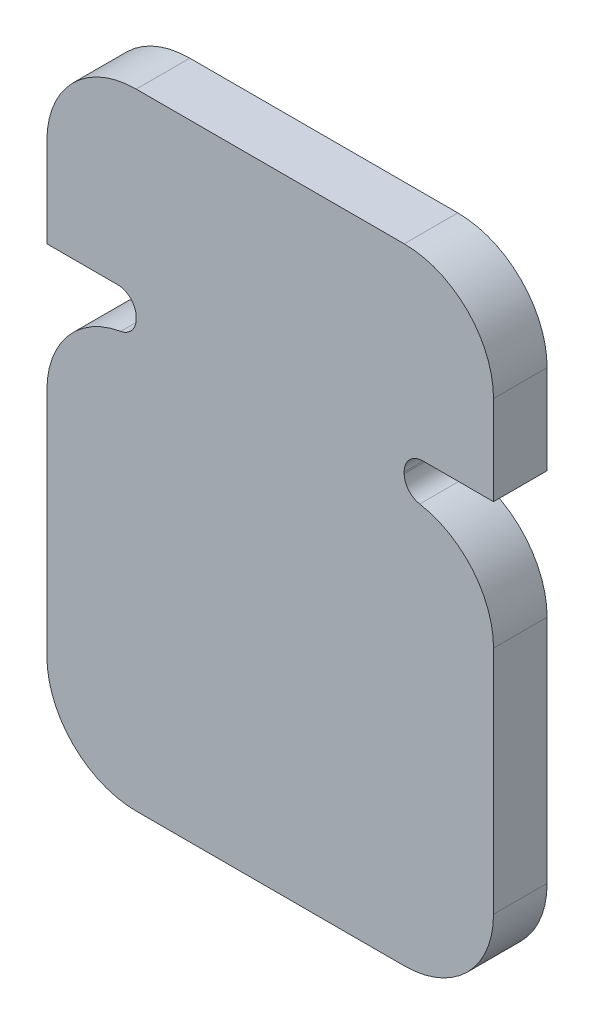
ISO-10303-21;
HEADER;
FILE_DESCRIPTION(('STEP AP214'),'2;1');
FILE_NAME('part.step','',(''),(''),'','','');
FILE_SCHEMA(('AUTOMOTIVE_DESIGN { 1 0 10303 214 1 1 1 1 }'));
ENDSEC;
DATA;
#1=APPLICATION_CONTEXT('core data for automotive mechanical design processes');
#2=APPLICATION_PROTOCOL_DEFINITION('international standard','automotive_design',2000,#1);
#3=PRODUCT_CONTEXT('',#1,'mechanical');
#4=PRODUCT('Part','Part','',(#3));
#5=PRODUCT_RELATED_PRODUCT_CATEGORY('part','',(#4));
#6=PRODUCT_DEFINITION_FORMATION('','',#4);
#7=PRODUCT_DEFINITION_CONTEXT('part definition',#1,'design');
#8=PRODUCT_DEFINITION('design','',#6,#7);
#9=PRODUCT_DEFINITION_SHAPE('','',#8);
#10=(LENGTH_UNIT() NAMED_UNIT(*) SI_UNIT(.MILLI.,.METRE.));
#11=(NAMED_UNIT(*) PLANE_ANGLE_UNIT() SI_UNIT($,.RADIAN.));
#12=(NAMED_UNIT(*) SI_UNIT($,.STERADIAN.) SOLID_ANGLE_UNIT());
#13=UNCERTAINTY_MEASURE_WITH_UNIT(LENGTH_MEASURE(1.E-05),#10,'distance_accuracy_value','');
#14=(GEOMETRIC_REPRESENTATION_CONTEXT(3) GLOBAL_UNCERTAINTY_ASSIGNED_CONTEXT((#13)) GLOBAL_UNIT_ASSIGNED_CONTEXT((#10,
#11,#12)) REPRESENTATION_CONTEXT('',''));
#15=CARTESIAN_POINT('',(0.,0.,0.));
#16=DIRECTION('',(0.,0.,1.));
#17=DIRECTION('',(1.,0.,0.));
#18=AXIS2_PLACEMENT_3D('',#15,#16,#17);
#19=CARTESIAN_POINT('',(-50.,30.,3.));
#20=DIRECTION('',(0.,-1.,0.));
#21=DIRECTION('',(0.,0.,-1.));
#22=AXIS2_PLACEMENT_3D('',#19,#20,#21);
#23=PLANE('',#22);
#24=DIRECTION('',(-1.,0.,0.));
#25=VECTOR('',#24,1.);
#26=CARTESIAN_POINT('',(-50.,30.,3.));
#27=LINE('',#26,#25);
#28=CARTESIAN_POINT('',(-30.,30.,3.));
#29=VERTEX_POINT('',#28);
#30=CARTESIAN_POINT('',(-45.,30.,3.));
#31=VERTEX_POINT('',#30);
#32=EDGE_CURVE('E203',#29,#31,#27,.T.);
#33=ORIENTED_EDGE('',*,*,#32,.F.);
#34=DIRECTION('',(0.,0.,-1.));
#35=VECTOR('',#34,1.);
#36=CARTESIAN_POINT('',(-30.,30.,3.));
#37=LINE('',#36,#35);
#38=CARTESIAN_POINT('',(-30.,30.,0.));
#39=VERTEX_POINT('',#38);
#40=EDGE_CURVE('E231',#29,#39,#37,.T.);
#41=ORIENTED_EDGE('',*,*,#40,.T.);
#42=DIRECTION('',(-1.,0.,0.));
#43=VECTOR('',#42,1.);
#44=CARTESIAN_POINT('',(-50.,30.,0.));
#45=LINE('',#44,#43);
#46=CARTESIAN_POINT('',(-45.,30.,0.));
#47=VERTEX_POINT('',#46);
#48=EDGE_CURVE('E172',#39,#47,#45,.T.);
#49=ORIENTED_EDGE('',*,*,#48,.T.);
#50=DIRECTION('',(0.,0.,-1.));
#51=VECTOR('',#50,1.);
#52=CARTESIAN_POINT('',(-45.,30.,3.));
#53=LINE('',#52,#51);
#54=EDGE_CURVE('E176',#47,#31,#53,.F.);
#55=ORIENTED_EDGE('',*,*,#54,.T.);
#56=EDGE_LOOP('',(#33,#41,#49,#55));
#57=FACE_BOUND('',#56,.T.);
#58=ADVANCED_FACE('F27',(#57),#23,.F.);
#59=CARTESIAN_POINT('',(-50.,30.,3.));
#60=DIRECTION('',(1.,0.,0.));
#61=DIRECTION('',(0.,1.,0.));
#62=AXIS2_PLACEMENT_3D('',#59,#60,#61);
#63=PLANE('',#62);
#64=DIRECTION('',(0.,-1.,0.));
#65=VECTOR('',#64,1.);
#66=CARTESIAN_POINT('',(-50.,30.,3.));
#67=LINE('',#66,#65);
#68=CARTESIAN_POINT('',(-50.,25.,3.));
#69=VERTEX_POINT('',#68);
#70=CARTESIAN_POINT('',(-50.,20.,3.));
#71=VERTEX_POINT('',#70);
#72=EDGE_CURVE('E206',#69,#71,#67,.T.);
#73=ORIENTED_EDGE('',*,*,#72,.F.);
#74=DIRECTION('',(0.,0.,-1.));
#75=VECTOR('',#74,1.);
#76=CARTESIAN_POINT('',(-50.,25.,3.));
#77=LINE('',#76,#75);
#78=CARTESIAN_POINT('',(-50.,25.,0.));
#79=VERTEX_POINT('',#78);
#80=EDGE_CURVE('E170',#69,#79,#77,.T.);
#81=ORIENTED_EDGE('',*,*,#80,.T.);
#82=DIRECTION('',(0.,-1.,0.));
#83=VECTOR('',#82,1.);
#84=CARTESIAN_POINT('',(-50.,30.,0.));
#85=LINE('',#84,#83);
#86=CARTESIAN_POINT('',(-50.,20.,0.));
#87=VERTEX_POINT('',#86);
#88=EDGE_CURVE('E164',#79,#87,#85,.T.);
#89=ORIENTED_EDGE('',*,*,#88,.T.);
#90=DIRECTION('',(0.,0.,-1.));
#91=VECTOR('',#90,1.);
#92=CARTESIAN_POINT('',(-50.,20.,3.));
#93=LINE('',#92,#91);
#94=EDGE_CURVE('E168',#71,#87,#93,.T.);
#95=ORIENTED_EDGE('',*,*,#94,.F.);
#96=EDGE_LOOP('',(#73,#81,#89,#95));
#97=FACE_BOUND('',#96,.T.);
#98=ADVANCED_FACE('F167',(#97),#63,.F.);
#99=CARTESIAN_POINT('',(-50.,20.,3.));
#100=DIRECTION('',(0.,1.,0.));
#101=DIRECTION('',(0.,0.,1.));
#102=AXIS2_PLACEMENT_3D('',#99,#100,#101);
#103=PLANE('',#102);
#104=DIRECTION('',(1.,0.,0.));
#105=VECTOR('',#104,1.);
#106=CARTESIAN_POINT('',(-50.,20.,0.));
#107=LINE('',#106,#105);
#108=CARTESIAN_POINT('',(-46.05,20.,0.));
#109=VERTEX_POINT('',#108);
#110=EDGE_CURVE('E171',#87,#109,#107,.T.);
#111=ORIENTED_EDGE('',*,*,#110,.T.);
#112=DIRECTION('',(0.,0.,-1.));
#113=VECTOR('',#112,1.);
#114=CARTESIAN_POINT('',(-46.05,20.,3.));
#115=LINE('',#114,#113);
#116=CARTESIAN_POINT('',(-46.05,20.,3.));
#117=VERTEX_POINT('',#116);
#118=EDGE_CURVE('E41',#109,#117,#115,.F.);
#119=ORIENTED_EDGE('',*,*,#118,.T.);
#120=DIRECTION('',(1.,0.,0.));
#121=VECTOR('',#120,1.);
#122=CARTESIAN_POINT('',(-50.,20.,3.));
#123=LINE('',#122,#121);
#124=EDGE_CURVE('E175',#71,#117,#123,.T.);
#125=ORIENTED_EDGE('',*,*,#124,.F.);
#126=ORIENTED_EDGE('',*,*,#94,.T.);
#127=EDGE_LOOP('',(#111,#119,#125,#126));
#128=FACE_BOUND('',#127,.T.);
#129=ADVANCED_FACE('F174',(#128),#103,.F.);
#130=CARTESIAN_POINT('',(-45.,20.,3.));
#131=DIRECTION('',(1.,0.,0.));
#132=DIRECTION('',(0.,0.,-1.));
#133=AXIS2_PLACEMENT_3D('',#130,#131,#132);
#134=PLANE('',#133);
#135=DIRECTION('',(0.,-1.,0.));
#136=VECTOR('',#135,1.);
#137=CARTESIAN_POINT('',(-45.,20.,0.));
#138=LINE('',#137,#136);
#139=CARTESIAN_POINT('',(-45.,18.95,0.));
#140=VERTEX_POINT('',#139);
#141=CARTESIAN_POINT('',(-45.,18.8581876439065,0.));
#142=VERTEX_POINT('',#141);
#143=EDGE_CURVE('E181',#140,#142,#138,.T.);
#144=ORIENTED_EDGE('',*,*,#143,.T.);
#145=DIRECTION('',(0.,0.,-1.));
#146=VECTOR('',#145,1.);
#147=CARTESIAN_POINT('',(-45.,18.8581876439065,3.));
#148=LINE('',#147,#146);
#149=CARTESIAN_POINT('',(-45.,18.8581876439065,3.));
#150=VERTEX_POINT('',#149);
#151=EDGE_CURVE('E296',#142,#150,#148,.F.);
#152=ORIENTED_EDGE('',*,*,#151,.T.);
#153=DIRECTION('',(0.,-1.,0.));
#154=VECTOR('',#153,1.);
#155=CARTESIAN_POINT('',(-45.,20.,3.));
#156=LINE('',#155,#154);
#157=CARTESIAN_POINT('',(-45.,18.95,3.));
#158=VERTEX_POINT('',#157);
#159=EDGE_CURVE('E209',#158,#150,#156,.T.);
#160=ORIENTED_EDGE('',*,*,#159,.F.);
#161=DIRECTION('',(0.,0.,-1.));
#162=VECTOR('',#161,1.);
#163=CARTESIAN_POINT('',(-45.,18.95,0.));
#164=LINE('',#163,#162);
#165=EDGE_CURVE('E293',#158,#140,#164,.T.);
#166=ORIENTED_EDGE('',*,*,#165,.T.);
#167=EDGE_LOOP('',(#144,#152,#160,#166));
#168=FACE_BOUND('',#167,.T.);
#169=ADVANCED_FACE('F325',(#168),#134,.F.);
#170=CARTESIAN_POINT('',(-50.,17.9,3.));
#171=DIRECTION('',(1.,0.,0.));
#172=DIRECTION('',(0.,0.,-1.));
#173=AXIS2_PLACEMENT_3D('',#170,#171,#172);
#174=PLANE('',#173);
#175=DIRECTION('',(0.,-1.,0.));
#176=VECTOR('',#175,1.);
#177=CARTESIAN_POINT('',(-50.,17.9,3.));
#178=LINE('',#177,#176);
#179=CARTESIAN_POINT('',(-50.,12.9,3.));
#180=VERTEX_POINT('',#179);
#181=CARTESIAN_POINT('',(-50.,0.,3.));
#182=VERTEX_POINT('',#181);
#183=EDGE_CURVE('E212',#180,#182,#178,.T.);
#184=ORIENTED_EDGE('',*,*,#183,.F.);
#185=DIRECTION('',(0.,0.,-1.));
#186=VECTOR('',#185,1.);
#187=CARTESIAN_POINT('',(-50.,12.9,3.));
#188=LINE('',#187,#186);
#189=CARTESIAN_POINT('',(-50.,12.9,0.));
#190=VERTEX_POINT('',#189);
#191=EDGE_CURVE('E277',#180,#190,#188,.T.);
#192=ORIENTED_EDGE('',*,*,#191,.T.);
#193=DIRECTION('',(0.,-1.,0.));
#194=VECTOR('',#193,1.);
#195=CARTESIAN_POINT('',(-50.,17.9,0.));
#196=LINE('',#195,#194);
#197=CARTESIAN_POINT('',(-50.,0.,0.));
#198=VERTEX_POINT('',#197);
#199=EDGE_CURVE('E184',#190,#198,#196,.T.);
#200=ORIENTED_EDGE('',*,*,#199,.T.);
#201=DIRECTION('',(0.,0.,-1.));
#202=VECTOR('',#201,1.);
#203=CARTESIAN_POINT('',(-50.,0.,3.));
#204=LINE('',#203,#202);
#205=EDGE_CURVE('E258',#198,#182,#204,.F.);
#206=ORIENTED_EDGE('',*,*,#205,.T.);
#207=EDGE_LOOP('',(#184,#192,#200,#206));
#208=FACE_BOUND('',#207,.T.);
#209=ADVANCED_FACE('F389',(#208),#174,.F.);
#210=CARTESIAN_POINT('',(-50.,-5.,3.));
#211=DIRECTION('',(0.,1.,0.));
#212=DIRECTION('',(0.,0.,1.));
#213=AXIS2_PLACEMENT_3D('',#210,#211,#212);
#214=PLANE('',#213);
#215=DIRECTION('',(1.,0.,0.));
#216=VECTOR('',#215,1.);
#217=CARTESIAN_POINT('',(-50.,-5.,3.));
#218=LINE('',#217,#216);
#219=CARTESIAN_POINT('',(-45.,-5.,3.));
#220=VERTEX_POINT('',#219);
#221=CARTESIAN_POINT('',(-30.,-5.,3.));
#222=VERTEX_POINT('',#221);
#223=EDGE_CURVE('E214',#220,#222,#218,.T.);
#224=ORIENTED_EDGE('',*,*,#223,.F.);
#225=DIRECTION('',(0.,0.,-1.));
#226=VECTOR('',#225,1.);
#227=CARTESIAN_POINT('',(-45.,-5.,3.));
#228=LINE('',#227,#226);
#229=CARTESIAN_POINT('',(-45.,-5.,0.));
#230=VERTEX_POINT('',#229);
#231=EDGE_CURVE('E255',#220,#230,#228,.T.);
#232=ORIENTED_EDGE('',*,*,#231,.T.);
#233=DIRECTION('',(1.,0.,0.));
#234=VECTOR('',#233,1.);
#235=CARTESIAN_POINT('',(-50.,-5.,0.));
#236=LINE('',#235,#234);
#237=CARTESIAN_POINT('',(-30.,-5.,0.));
#238=VERTEX_POINT('',#237);
#239=EDGE_CURVE('E189',#230,#238,#236,.T.);
#240=ORIENTED_EDGE('',*,*,#239,.T.);
#241=DIRECTION('',(0.,0.,-1.));
#242=VECTOR('',#241,1.);
#243=CARTESIAN_POINT('',(-30.,-5.,3.));
#244=LINE('',#243,#242);
#245=EDGE_CURVE('E253',#238,#222,#244,.F.);
#246=ORIENTED_EDGE('',*,*,#245,.T.);
#247=EDGE_LOOP('',(#224,#232,#240,#246));
#248=FACE_BOUND('',#247,.T.);
#249=ADVANCED_FACE('F382',(#248),#214,.F.);
#250=CARTESIAN_POINT('',(-25.,17.9,3.));
#251=DIRECTION('',(-1.,0.,0.));
#252=DIRECTION('',(0.,0.,1.));
#253=AXIS2_PLACEMENT_3D('',#250,#251,#252);
#254=PLANE('',#253);
#255=DIRECTION('',(0.,1.,0.));
#256=VECTOR('',#255,1.);
#257=CARTESIAN_POINT('',(-25.,17.9,0.));
#258=LINE('',#257,#256);
#259=CARTESIAN_POINT('',(-25.,0.,0.));
#260=VERTEX_POINT('',#259);
#261=CARTESIAN_POINT('',(-25.,12.9,0.));
#262=VERTEX_POINT('',#261);
#263=EDGE_CURVE('E192',#260,#262,#258,.T.);
#264=ORIENTED_EDGE('',*,*,#263,.T.);
#265=DIRECTION('',(0.,0.,-1.));
#266=VECTOR('',#265,1.);
#267=CARTESIAN_POINT('',(-25.,12.9,3.));
#268=LINE('',#267,#266);
#269=CARTESIAN_POINT('',(-25.,12.9,3.));
#270=VERTEX_POINT('',#269);
#271=EDGE_CURVE('E270',#262,#270,#268,.F.);
#272=ORIENTED_EDGE('',*,*,#271,.T.);
#273=DIRECTION('',(0.,1.,0.));
#274=VECTOR('',#273,1.);
#275=CARTESIAN_POINT('',(-25.,17.9,3.));
#276=LINE('',#275,#274);
#277=CARTESIAN_POINT('',(-25.,0.,3.));
#278=VERTEX_POINT('',#277);
#279=EDGE_CURVE('E217',#278,#270,#276,.T.);
#280=ORIENTED_EDGE('',*,*,#279,.F.);
#281=DIRECTION('',(0.,0.,-1.));
#282=VECTOR('',#281,1.);
#283=CARTESIAN_POINT('',(-25.,0.,3.));
#284=LINE('',#283,#282);
#285=EDGE_CURVE('E261',#278,#260,#284,.T.);
#286=ORIENTED_EDGE('',*,*,#285,.T.);
#287=EDGE_LOOP('',(#264,#272,#280,#286));
#288=FACE_BOUND('',#287,.T.);
#289=ADVANCED_FACE('F373',(#288),#254,.F.);
#290=CARTESIAN_POINT('',(-30.,20.,3.));
#291=DIRECTION('',(-1.,0.,0.));
#292=DIRECTION('',(0.,0.,1.));
#293=AXIS2_PLACEMENT_3D('',#290,#291,#292);
#294=PLANE('',#293);
#295=DIRECTION('',(0.,1.,0.));
#296=VECTOR('',#295,1.);
#297=CARTESIAN_POINT('',(-30.,20.,3.));
#298=LINE('',#297,#296);
#299=CARTESIAN_POINT('',(-30.,18.8581876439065,3.));
#300=VERTEX_POINT('',#299);
#301=CARTESIAN_POINT('',(-30.,18.95,3.));
#302=VERTEX_POINT('',#301);
#303=EDGE_CURVE('E220',#300,#302,#298,.T.);
#304=ORIENTED_EDGE('',*,*,#303,.F.);
#305=DIRECTION('',(0.,0.,-1.));
#306=VECTOR('',#305,1.);
#307=CARTESIAN_POINT('',(-30.,18.8581876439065,3.));
#308=LINE('',#307,#306);
#309=CARTESIAN_POINT('',(-30.,18.8581876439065,0.));
#310=VERTEX_POINT('',#309);
#311=EDGE_CURVE('E282',#300,#310,#308,.T.);
#312=ORIENTED_EDGE('',*,*,#311,.T.);
#313=DIRECTION('',(0.,1.,0.));
#314=VECTOR('',#313,1.);
#315=CARTESIAN_POINT('',(-30.,20.,0.));
#316=LINE('',#315,#314);
#317=CARTESIAN_POINT('',(-30.,18.95,0.));
#318=VERTEX_POINT('',#317);
#319=EDGE_CURVE('E195',#310,#318,#316,.T.);
#320=ORIENTED_EDGE('',*,*,#319,.T.);
#321=DIRECTION('',(0.,0.,-1.));
#322=VECTOR('',#321,1.);
#323=CARTESIAN_POINT('',(-30.,18.95,3.));
#324=LINE('',#323,#322);
#325=EDGE_CURVE('E280',#318,#302,#324,.F.);
#326=ORIENTED_EDGE('',*,*,#325,.T.);
#327=EDGE_LOOP('',(#304,#312,#320,#326));
#328=FACE_BOUND('',#327,.T.);
#329=ADVANCED_FACE('F357',(#328),#294,.F.);
#330=CARTESIAN_POINT('',(-25.,20.,3.));
#331=DIRECTION('',(0.,1.,0.));
#332=DIRECTION('',(-1.,0.,0.));
#333=AXIS2_PLACEMENT_3D('',#330,#331,#332);
#334=PLANE('',#333);
#335=DIRECTION('',(1.,0.,0.));
#336=VECTOR('',#335,1.);
#337=CARTESIAN_POINT('',(-25.,20.,3.));
#338=LINE('',#337,#336);
#339=CARTESIAN_POINT('',(-28.95,20.,3.));
#340=VERTEX_POINT('',#339);
#341=CARTESIAN_POINT('',(-25.,20.,3.));
#342=VERTEX_POINT('',#341);
#343=EDGE_CURVE('E223',#340,#342,#338,.T.);
#344=ORIENTED_EDGE('',*,*,#343,.F.);
#345=DIRECTION('',(0.,0.,-1.));
#346=VECTOR('',#345,1.);
#347=CARTESIAN_POINT('',(-28.95,20.,0.));
#348=LINE('',#347,#346);
#349=CARTESIAN_POINT('',(-28.95,20.,0.));
#350=VERTEX_POINT('',#349);
#351=EDGE_CURVE('E287',#340,#350,#348,.T.);
#352=ORIENTED_EDGE('',*,*,#351,.T.);
#353=DIRECTION('',(1.,0.,0.));
#354=VECTOR('',#353,1.);
#355=CARTESIAN_POINT('',(-25.,20.,0.));
#356=LINE('',#355,#354);
#357=CARTESIAN_POINT('',(-25.,20.,0.));
#358=VERTEX_POINT('',#357);
#359=EDGE_CURVE('E198',#350,#358,#356,.T.);
#360=ORIENTED_EDGE('',*,*,#359,.T.);
#361=DIRECTION('',(0.,0.,-1.));
#362=VECTOR('',#361,1.);
#363=CARTESIAN_POINT('',(-25.,20.,3.));
#364=LINE('',#363,#362);
#365=EDGE_CURVE('E177',#342,#358,#364,.T.);
#366=ORIENTED_EDGE('',*,*,#365,.F.);
#367=EDGE_LOOP('',(#344,#352,#360,#366));
#368=FACE_BOUND('',#367,.T.);
#369=ADVANCED_FACE('F351',(#368),#334,.F.);
#370=CARTESIAN_POINT('',(-25.,30.,3.));
#371=DIRECTION('',(-1.,0.,0.));
#372=DIRECTION('',(0.,-1.,0.));
#373=AXIS2_PLACEMENT_3D('',#370,#371,#372);
#374=PLANE('',#373);
#375=DIRECTION('',(0.,1.,0.));
#376=VECTOR('',#375,1.);
#377=CARTESIAN_POINT('',(-25.,30.,0.));
#378=LINE('',#377,#376);
#379=CARTESIAN_POINT('',(-25.,25.,0.));
#380=VERTEX_POINT('',#379);
#381=EDGE_CURVE('E200',#358,#380,#378,.T.);
#382=ORIENTED_EDGE('',*,*,#381,.T.);
#383=DIRECTION('',(0.,0.,-1.));
#384=VECTOR('',#383,1.);
#385=CARTESIAN_POINT('',(-25.,25.,3.));
#386=LINE('',#385,#384);
#387=CARTESIAN_POINT('',(-25.,25.,3.));
#388=VERTEX_POINT('',#387);
#389=EDGE_CURVE('E243',#380,#388,#386,.F.);
#390=ORIENTED_EDGE('',*,*,#389,.T.);
#391=DIRECTION('',(0.,1.,0.));
#392=VECTOR('',#391,1.);
#393=CARTESIAN_POINT('',(-25.,30.,3.));
#394=LINE('',#393,#392);
#395=EDGE_CURVE('E225',#342,#388,#394,.T.);
#396=ORIENTED_EDGE('',*,*,#395,.F.);
#397=ORIENTED_EDGE('',*,*,#365,.T.);
#398=EDGE_LOOP('',(#382,#390,#396,#397));
#399=FACE_BOUND('',#398,.T.);
#400=ADVANCED_FACE('F346',(#399),#374,.F.);
#401=CARTESIAN_POINT('',(-30.,30.,3.));
#402=DIRECTION('',(0.,0.,-1.));
#403=DIRECTION('',(-1.,0.,0.));
#404=AXIS2_PLACEMENT_3D('',#401,#402,#403);
#405=PLANE('',#404);
#406=ORIENTED_EDGE('',*,*,#279,.T.);
#407=CARTESIAN_POINT('',(-30.,12.9,3.));
#408=DIRECTION('',(0.,0.,-1.));
#409=DIRECTION('',(-1.,0.,0.));
#410=AXIS2_PLACEMENT_3D('',#407,#408,#409);
#411=CIRCLE('',#410,5.);
#412=CARTESIAN_POINT('',(-29.1322314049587,17.8241220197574,3.));
#413=VERTEX_POINT('',#412);
#414=EDGE_CURVE('E274',#270,#413,#411,.F.);
#415=ORIENTED_EDGE('',*,*,#414,.T.);
#416=CARTESIAN_POINT('',(-28.95,18.8581876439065,3.));
#417=DIRECTION('',(0.,0.,-1.));
#418=DIRECTION('',(-1.,0.,0.));
#419=AXIS2_PLACEMENT_3D('',#416,#417,#418);
#420=CIRCLE('',#419,1.05);
#421=EDGE_CURVE('E301',#413,#300,#420,.T.);
#422=ORIENTED_EDGE('',*,*,#421,.T.);
#423=ORIENTED_EDGE('',*,*,#303,.T.);
#424=CARTESIAN_POINT('',(-28.95,18.95,3.));
#425=DIRECTION('',(0.,0.,-1.));
#426=DIRECTION('',(-1.,0.,0.));
#427=AXIS2_PLACEMENT_3D('',#424,#425,#426);
#428=CIRCLE('',#427,1.05);
#429=EDGE_CURVE('E305',#302,#340,#428,.T.);
#430=ORIENTED_EDGE('',*,*,#429,.T.);
#431=ORIENTED_EDGE('',*,*,#343,.T.);
#432=ORIENTED_EDGE('',*,*,#395,.T.);
#433=CARTESIAN_POINT('',(-30.,25.,3.));
#434=DIRECTION('',(0.,0.,-1.));
#435=DIRECTION('',(-1.,0.,0.));
#436=AXIS2_PLACEMENT_3D('',#433,#434,#435);
#437=CIRCLE('',#436,5.);
#438=EDGE_CURVE('E251',#388,#29,#437,.F.);
#439=ORIENTED_EDGE('',*,*,#438,.T.);
#440=ORIENTED_EDGE('',*,*,#32,.T.);
#441=CARTESIAN_POINT('',(-45.,25.,3.));
#442=DIRECTION('',(0.,0.,-1.));
#443=DIRECTION('',(-1.,0.,0.));
#444=AXIS2_PLACEMENT_3D('',#441,#442,#443);
#445=CIRCLE('',#444,5.);
#446=EDGE_CURVE('E245',#31,#69,#445,.F.);
#447=ORIENTED_EDGE('',*,*,#446,.T.);
#448=ORIENTED_EDGE('',*,*,#72,.T.);
#449=ORIENTED_EDGE('',*,*,#124,.T.);
#450=CARTESIAN_POINT('',(-46.05,18.95,3.));
#451=DIRECTION('',(0.,0.,-1.));
#452=DIRECTION('',(-1.,0.,0.));
#453=AXIS2_PLACEMENT_3D('',#450,#451,#452);
#454=CIRCLE('',#453,1.05);
#455=EDGE_CURVE('E11',#117,#158,#454,.T.);
#456=ORIENTED_EDGE('',*,*,#455,.T.);
#457=ORIENTED_EDGE('',*,*,#159,.T.);
#458=CARTESIAN_POINT('',(-46.05,18.8581876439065,3.));
#459=DIRECTION('',(0.,0.,-1.));
#460=DIRECTION('',(-1.,0.,0.));
#461=AXIS2_PLACEMENT_3D('',#458,#459,#460);
#462=CIRCLE('',#461,1.05);
#463=CARTESIAN_POINT('',(-45.8677685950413,17.8241220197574,3.));
#464=VERTEX_POINT('',#463);
#465=EDGE_CURVE('E309',#150,#464,#462,.T.);
#466=ORIENTED_EDGE('',*,*,#465,.T.);
#467=CARTESIAN_POINT('',(-45.,12.9,3.));
#468=DIRECTION('',(0.,0.,-1.));
#469=DIRECTION('',(-1.,0.,0.));
#470=AXIS2_PLACEMENT_3D('',#467,#468,#469);
#471=CIRCLE('',#470,5.);
#472=EDGE_CURVE('E272',#464,#180,#471,.F.);
#473=ORIENTED_EDGE('',*,*,#472,.T.);
#474=ORIENTED_EDGE('',*,*,#183,.T.);
#475=CARTESIAN_POINT('',(-45.,0.,3.));
#476=DIRECTION('',(0.,0.,-1.));
#477=DIRECTION('',(-1.,0.,0.));
#478=AXIS2_PLACEMENT_3D('',#475,#476,#477);
#479=CIRCLE('',#478,5.);
#480=EDGE_CURVE('E249',#182,#220,#479,.F.);
#481=ORIENTED_EDGE('',*,*,#480,.T.);
#482=ORIENTED_EDGE('',*,*,#223,.T.);
#483=CARTESIAN_POINT('',(-30.,0.,3.));
#484=DIRECTION('',(0.,0.,-1.));
#485=DIRECTION('',(-1.,0.,0.));
#486=AXIS2_PLACEMENT_3D('',#483,#484,#485);
#487=CIRCLE('',#486,5.);
#488=EDGE_CURVE('E247',#222,#278,#487,.F.);
#489=ORIENTED_EDGE('',*,*,#488,.T.);
#490=EDGE_LOOP('',(#406,#415,#422,#423,#430,#431,#432,#439,#440,#447,#448,#449,#456,#457,#466,
#473,#474,#481,#482,#489));
#491=FACE_BOUND('',#490,.T.);
#492=ADVANCED_FACE('F313',(#491),#405,.F.);
#493=CARTESIAN_POINT('',(-30.,30.,0.));
#494=DIRECTION('',(0.,0.,-1.));
#495=DIRECTION('',(-1.,0.,0.));
#496=AXIS2_PLACEMENT_3D('',#493,#494,#495);
#497=PLANE('',#496);
#498=ORIENTED_EDGE('',*,*,#319,.F.);
#499=CARTESIAN_POINT('',(-28.95,18.8581876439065,0.));
#500=DIRECTION('',(0.,0.,-1.));
#501=DIRECTION('',(-1.,0.,0.));
#502=AXIS2_PLACEMENT_3D('',#499,#500,#501);
#503=CIRCLE('',#502,1.05);
#504=CARTESIAN_POINT('',(-29.1322314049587,17.8241220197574,0.));
#505=VERTEX_POINT('',#504);
#506=EDGE_CURVE('E299',#310,#505,#503,.F.);
#507=ORIENTED_EDGE('',*,*,#506,.T.);
#508=CARTESIAN_POINT('',(-30.,12.9,0.));
#509=DIRECTION('',(0.,0.,-1.));
#510=DIRECTION('',(-1.,0.,0.));
#511=AXIS2_PLACEMENT_3D('',#508,#509,#510);
#512=CIRCLE('',#511,5.);
#513=EDGE_CURVE('E268',#505,#262,#512,.T.);
#514=ORIENTED_EDGE('',*,*,#513,.T.);
#515=ORIENTED_EDGE('',*,*,#263,.F.);
#516=CARTESIAN_POINT('',(-30.,0.,0.));
#517=DIRECTION('',(0.,0.,-1.));
#518=DIRECTION('',(-1.,0.,0.));
#519=AXIS2_PLACEMENT_3D('',#516,#517,#518);
#520=CIRCLE('',#519,5.);
#521=EDGE_CURVE('E236',#260,#238,#520,.T.);
#522=ORIENTED_EDGE('',*,*,#521,.T.);
#523=ORIENTED_EDGE('',*,*,#239,.F.);
#524=CARTESIAN_POINT('',(-45.,0.,0.));
#525=DIRECTION('',(0.,0.,-1.));
#526=DIRECTION('',(-1.,0.,0.));
#527=AXIS2_PLACEMENT_3D('',#524,#525,#526);
#528=CIRCLE('',#527,5.);
#529=EDGE_CURVE('E238',#230,#198,#528,.T.);
#530=ORIENTED_EDGE('',*,*,#529,.T.);
#531=ORIENTED_EDGE('',*,*,#199,.F.);
#532=CARTESIAN_POINT('',(-45.,12.9,0.));
#533=DIRECTION('',(0.,0.,-1.));
#534=DIRECTION('',(-1.,0.,0.));
#535=AXIS2_PLACEMENT_3D('',#532,#533,#534);
#536=CIRCLE('',#535,5.);
#537=CARTESIAN_POINT('',(-45.8677685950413,17.8241220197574,0.));
#538=VERTEX_POINT('',#537);
#539=EDGE_CURVE('E265',#190,#538,#536,.T.);
#540=ORIENTED_EDGE('',*,*,#539,.T.);
#541=CARTESIAN_POINT('',(-46.05,18.8581876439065,0.));
#542=DIRECTION('',(0.,0.,-1.));
#543=DIRECTION('',(-1.,0.,0.));
#544=AXIS2_PLACEMENT_3D('',#541,#542,#543);
#545=CIRCLE('',#544,1.05);
#546=EDGE_CURVE('E307',#538,#142,#545,.F.);
#547=ORIENTED_EDGE('',*,*,#546,.T.);
#548=ORIENTED_EDGE('',*,*,#143,.F.);
#549=CARTESIAN_POINT('',(-46.05,18.95,0.));
#550=DIRECTION('',(0.,0.,-1.));
#551=DIRECTION('',(-1.,0.,0.));
#552=AXIS2_PLACEMENT_3D('',#549,#550,#551);
#553=CIRCLE('',#552,1.05);
#554=EDGE_CURVE('E34',#140,#109,#553,.F.);
#555=ORIENTED_EDGE('',*,*,#554,.T.);
#556=ORIENTED_EDGE('',*,*,#110,.F.);
#557=ORIENTED_EDGE('',*,*,#88,.F.);
#558=CARTESIAN_POINT('',(-45.,25.,0.));
#559=DIRECTION('',(0.,0.,-1.));
#560=DIRECTION('',(-1.,0.,0.));
#561=AXIS2_PLACEMENT_3D('',#558,#559,#560);
#562=CIRCLE('',#561,5.);
#563=EDGE_CURVE('E234',#79,#47,#562,.T.);
#564=ORIENTED_EDGE('',*,*,#563,.T.);
#565=ORIENTED_EDGE('',*,*,#48,.F.);
#566=CARTESIAN_POINT('',(-30.,25.,0.));
#567=DIRECTION('',(0.,0.,-1.));
#568=DIRECTION('',(-1.,0.,0.));
#569=AXIS2_PLACEMENT_3D('',#566,#567,#568);
#570=CIRCLE('',#569,5.);
#571=EDGE_CURVE('E241',#39,#380,#570,.T.);
#572=ORIENTED_EDGE('',*,*,#571,.T.);
#573=ORIENTED_EDGE('',*,*,#381,.F.);
#574=ORIENTED_EDGE('',*,*,#359,.F.);
#575=CARTESIAN_POINT('',(-28.95,18.95,0.));
#576=DIRECTION('',(0.,0.,-1.));
#577=DIRECTION('',(-1.,0.,0.));
#578=AXIS2_PLACEMENT_3D('',#575,#576,#577);
#579=CIRCLE('',#578,1.05);
#580=EDGE_CURVE('E303',#350,#318,#579,.F.);
#581=ORIENTED_EDGE('',*,*,#580,.T.);
#582=EDGE_LOOP('',(#498,#507,#514,#515,#522,#523,#530,#531,#540,#547,#548,#555,#556,#557,#564,
#565,#572,#573,#574,#581));
#583=FACE_BOUND('',#582,.T.);
#584=ADVANCED_FACE('F180',(#583),#497,.T.);
#585=CARTESIAN_POINT('',(-30.,25.,3.));
#586=DIRECTION('',(0.,0.,-1.));
#587=DIRECTION('',(-1.,0.,0.));
#588=AXIS2_PLACEMENT_3D('',#585,#586,#587);
#589=CYLINDRICAL_SURFACE('',#588,5.);
#590=ORIENTED_EDGE('',*,*,#438,.F.);
#591=ORIENTED_EDGE('',*,*,#389,.F.);
#592=ORIENTED_EDGE('',*,*,#571,.F.);
#593=ORIENTED_EDGE('',*,*,#40,.F.);
#594=EDGE_LOOP('',(#590,#591,#592,#593));
#595=FACE_BOUND('',#594,.T.);
#596=ADVANCED_FACE('F341',(#595),#589,.T.);
#597=CARTESIAN_POINT('',(-45.,0.,3.));
#598=DIRECTION('',(0.,0.,-1.));
#599=DIRECTION('',(-1.,0.,0.));
#600=AXIS2_PLACEMENT_3D('',#597,#598,#599);
#601=CYLINDRICAL_SURFACE('',#600,5.);
#602=ORIENTED_EDGE('',*,*,#480,.F.);
#603=ORIENTED_EDGE('',*,*,#205,.F.);
#604=ORIENTED_EDGE('',*,*,#529,.F.);
#605=ORIENTED_EDGE('',*,*,#231,.F.);
#606=EDGE_LOOP('',(#602,#603,#604,#605));
#607=FACE_BOUND('',#606,.T.);
#608=ADVANCED_FACE('F386',(#607),#601,.T.);
#609=CARTESIAN_POINT('',(-30.,0.,3.));
#610=DIRECTION('',(0.,0.,-1.));
#611=DIRECTION('',(-1.,0.,0.));
#612=AXIS2_PLACEMENT_3D('',#609,#610,#611);
#613=CYLINDRICAL_SURFACE('',#612,5.);
#614=ORIENTED_EDGE('',*,*,#488,.F.);
#615=ORIENTED_EDGE('',*,*,#245,.F.);
#616=ORIENTED_EDGE('',*,*,#521,.F.);
#617=ORIENTED_EDGE('',*,*,#285,.F.);
#618=EDGE_LOOP('',(#614,#615,#616,#617));
#619=FACE_BOUND('',#618,.T.);
#620=ADVANCED_FACE('F379',(#619),#613,.T.);
#621=CARTESIAN_POINT('',(-45.,25.,3.));
#622=DIRECTION('',(0.,0.,-1.));
#623=DIRECTION('',(-1.,0.,0.));
#624=AXIS2_PLACEMENT_3D('',#621,#622,#623);
#625=CYLINDRICAL_SURFACE('',#624,5.);
#626=ORIENTED_EDGE('',*,*,#446,.F.);
#627=ORIENTED_EDGE('',*,*,#54,.F.);
#628=ORIENTED_EDGE('',*,*,#563,.F.);
#629=ORIENTED_EDGE('',*,*,#80,.F.);
#630=EDGE_LOOP('',(#626,#627,#628,#629));
#631=FACE_BOUND('',#630,.T.);
#632=ADVANCED_FACE('F332',(#631),#625,.T.);
#633=CARTESIAN_POINT('',(-30.,12.9,3.));
#634=DIRECTION('',(0.,0.,-1.));
#635=DIRECTION('',(-1.,0.,0.));
#636=AXIS2_PLACEMENT_3D('',#633,#634,#635);
#637=CYLINDRICAL_SURFACE('',#636,5.);
#638=ORIENTED_EDGE('',*,*,#513,.F.);
#639=DIRECTION('',(0.,0.,-1.));
#640=VECTOR('',#639,1.);
#641=CARTESIAN_POINT('',(-29.1322314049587,17.8241220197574,3.));
#642=LINE('',#641,#640);
#643=EDGE_CURVE('E285',#505,#413,#642,.F.);
#644=ORIENTED_EDGE('',*,*,#643,.T.);
#645=ORIENTED_EDGE('',*,*,#414,.F.);
#646=ORIENTED_EDGE('',*,*,#271,.F.);
#647=EDGE_LOOP('',(#638,#644,#645,#646));
#648=FACE_BOUND('',#647,.T.);
#649=ADVANCED_FACE('F369',(#648),#637,.T.);
#650=CARTESIAN_POINT('',(-45.,12.9,3.));
#651=DIRECTION('',(0.,0.,-1.));
#652=DIRECTION('',(-1.,0.,0.));
#653=AXIS2_PLACEMENT_3D('',#650,#651,#652);
#654=CYLINDRICAL_SURFACE('',#653,5.);
#655=ORIENTED_EDGE('',*,*,#472,.F.);
#656=DIRECTION('',(0.,0.,-1.));
#657=VECTOR('',#656,1.);
#658=CARTESIAN_POINT('',(-45.8677685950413,17.8241220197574,3.));
#659=LINE('',#658,#657);
#660=EDGE_CURVE('E290',#464,#538,#659,.T.);
#661=ORIENTED_EDGE('',*,*,#660,.T.);
#662=ORIENTED_EDGE('',*,*,#539,.F.);
#663=ORIENTED_EDGE('',*,*,#191,.F.);
#664=EDGE_LOOP('',(#655,#661,#662,#663));
#665=FACE_BOUND('',#664,.T.);
#666=ADVANCED_FACE('F321',(#665),#654,.T.);
#667=CARTESIAN_POINT('',(-28.95,18.8581876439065,3.));
#668=DIRECTION('',(0.,0.,-1.));
#669=DIRECTION('',(-1.,0.,0.));
#670=AXIS2_PLACEMENT_3D('',#667,#668,#669);
#671=CYLINDRICAL_SURFACE('',#670,1.05);
#672=ORIENTED_EDGE('',*,*,#421,.F.);
#673=ORIENTED_EDGE('',*,*,#643,.F.);
#674=ORIENTED_EDGE('',*,*,#506,.F.);
#675=ORIENTED_EDGE('',*,*,#311,.F.);
#676=EDGE_LOOP('',(#672,#673,#674,#675));
#677=FACE_BOUND('',#676,.T.);
#678=ADVANCED_FACE('F363',(#677),#671,.F.);
#679=CARTESIAN_POINT('',(-28.95,18.95,3.));
#680=DIRECTION('',(0.,0.,1.));
#681=DIRECTION('',(1.,0.,0.));
#682=AXIS2_PLACEMENT_3D('',#679,#680,#681);
#683=CYLINDRICAL_SURFACE('',#682,1.05);
#684=ORIENTED_EDGE('',*,*,#429,.F.);
#685=ORIENTED_EDGE('',*,*,#325,.F.);
#686=ORIENTED_EDGE('',*,*,#580,.F.);
#687=ORIENTED_EDGE('',*,*,#351,.F.);
#688=EDGE_LOOP('',(#684,#685,#686,#687));
#689=FACE_BOUND('',#688,.T.);
#690=ADVANCED_FACE('F360',(#689),#683,.F.);
#691=CARTESIAN_POINT('',(-46.05,18.8581876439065,3.));
#692=DIRECTION('',(0.,0.,-1.));
#693=DIRECTION('',(-1.,0.,0.));
#694=AXIS2_PLACEMENT_3D('',#691,#692,#693);
#695=CYLINDRICAL_SURFACE('',#694,1.05);
#696=ORIENTED_EDGE('',*,*,#465,.F.);
#697=ORIENTED_EDGE('',*,*,#151,.F.);
#698=ORIENTED_EDGE('',*,*,#546,.F.);
#699=ORIENTED_EDGE('',*,*,#660,.F.);
#700=EDGE_LOOP('',(#696,#697,#698,#699));
#701=FACE_BOUND('',#700,.T.);
#702=ADVANCED_FACE('F322',(#701),#695,.F.);
#703=CARTESIAN_POINT('',(-46.05,18.95,3.));
#704=DIRECTION('',(0.,0.,1.));
#705=DIRECTION('',(1.,0.,0.));
#706=AXIS2_PLACEMENT_3D('',#703,#704,#705);
#707=CYLINDRICAL_SURFACE('',#706,1.05);
#708=ORIENTED_EDGE('',*,*,#455,.F.);
#709=ORIENTED_EDGE('',*,*,#118,.F.);
#710=ORIENTED_EDGE('',*,*,#554,.F.);
#711=ORIENTED_EDGE('',*,*,#165,.F.);
#712=EDGE_LOOP('',(#708,#709,#710,#711));
#713=FACE_BOUND('',#712,.T.);
#714=ADVANCED_FACE('F329',(#713),#707,.F.);
#715=CLOSED_SHELL('',(#58,#98,#129,#169,#209,#249,#289,#329,#369,#400,#492,#584,#596,#608,#620,
#632,#649,#666,#678,#690,#702,#714));
#716=MANIFOLD_SOLID_BREP('B2',#715);
#717=ADVANCED_BREP_SHAPE_REPRESENTATION('',(#18,#716),#14);
#718=SHAPE_DEFINITION_REPRESENTATION(#9,#717);
ENDSEC;
END-ISO-10303-21;
